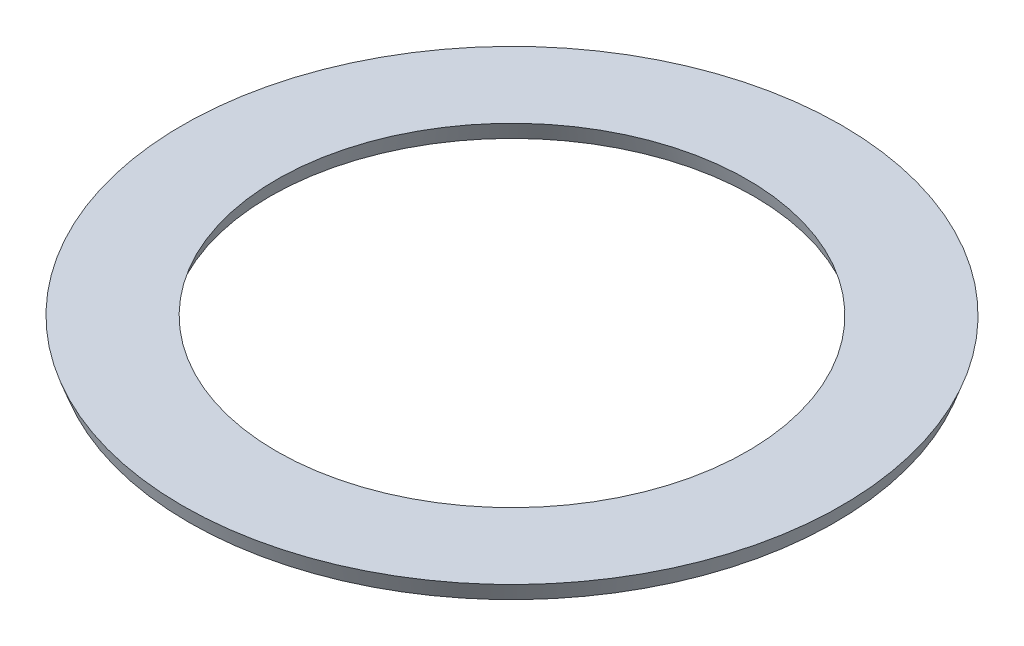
from build123d import *


with BuildPart() as part:
    # Esquisse1 → R_volution1 (revolve)
    with BuildSketch(Plane.XY, mode=Mode.PRIVATE) as r_volution1_sk:
        Polygon((-20, 0), (-28, 0), (-27.454044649, -1.5), (-20.545955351, -1.5), align=None)
    revolve(r_volution1_sk.sketch.rotate(Axis((0, 19.607491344, 0), (0, -1, 0)), 270), axis=Axis((0, 19.607491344, 0), (0, -1, 0)))


solid = part.part
